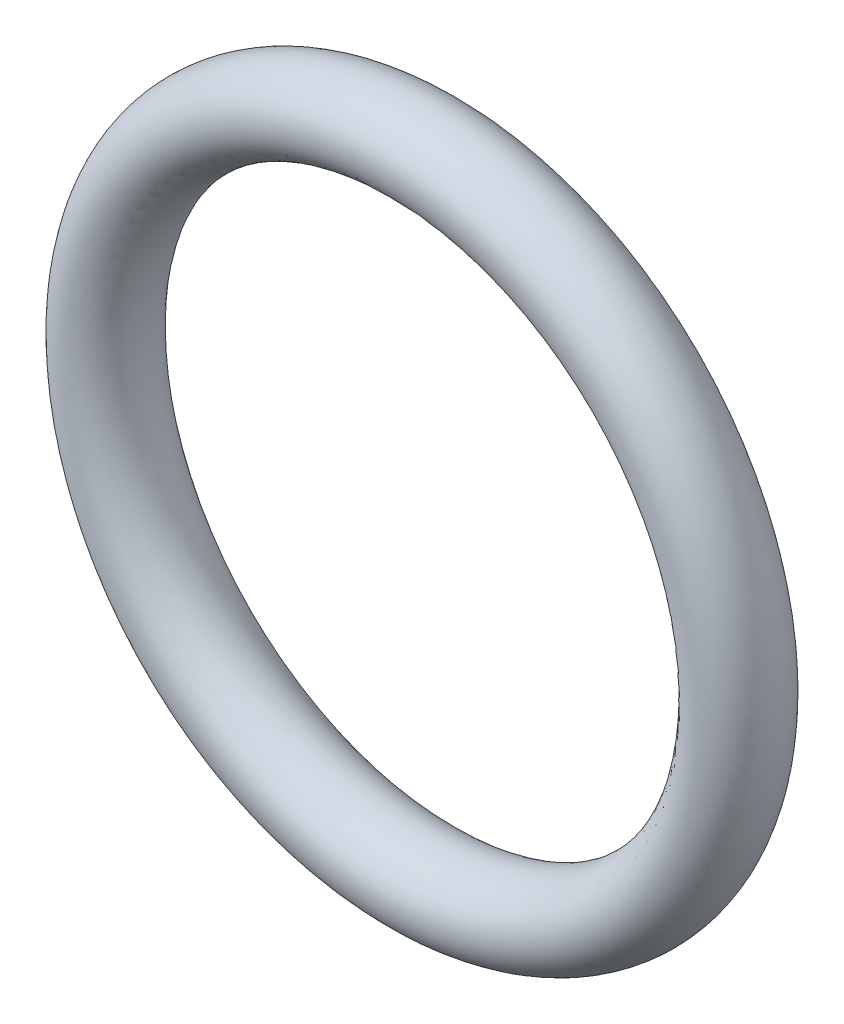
from build123d import *

# Parameters (mm, degrees)
ESQUISSE1_RX = 1.6
ESQUISSE1_RY = 1.45


with BuildPart() as part:
    # Esquisse1 → Base-R_volution (revolve)
    with BuildSketch(Plane(origin=(0, 0, 0), x_dir=(0, 0, -1), z_dir=(1, 0, 0))):
        with Locations((1.6, 11.45)):
            Ellipse(ESQUISSE1_RX, ESQUISSE1_RY)
    revolve(axis=Axis((0, 0, 0), (0, 0, -1)))


solid = part.part
